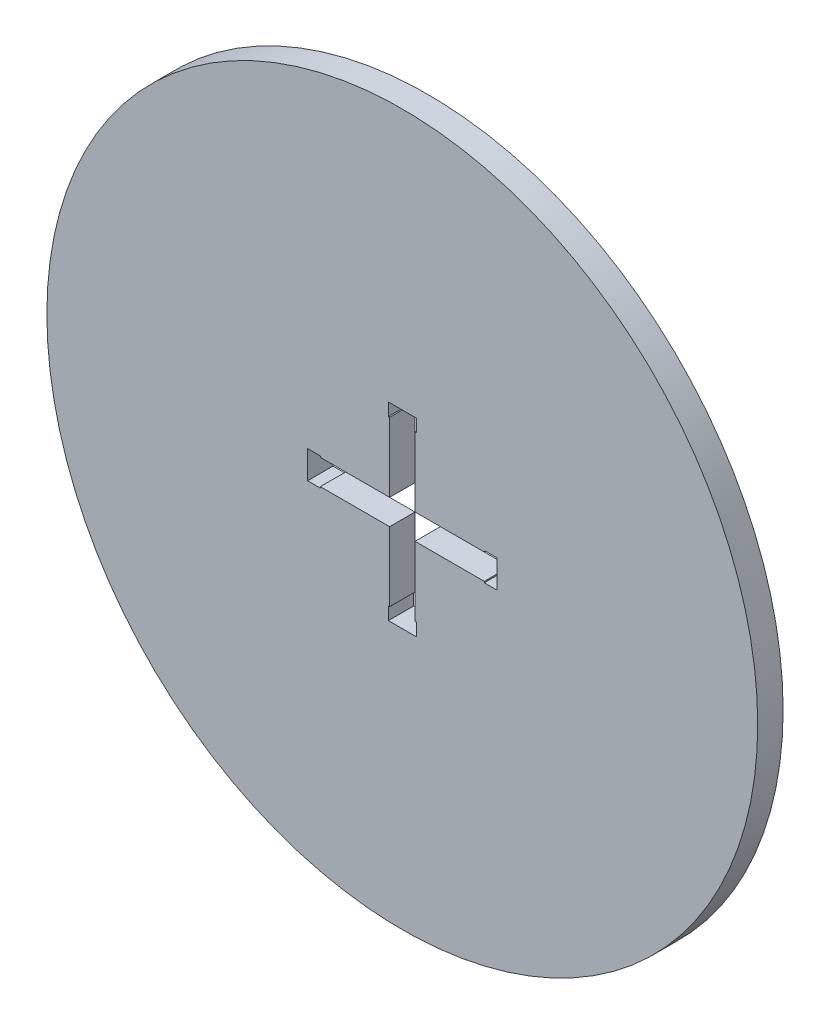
from build123d import *

# Parameters (mm, degrees)
CROQUIS1_R                                   = 177.8
SALIENTE_EXTRUIR1_DEPTH                      = 12.7
CORTAR_EXTRUIR3_DEPTH                        = 252.76769054
CROQUIS4_W                                   = 0.635
CROQUIS4_H                                   = 6.35
CROQUIS4_W_2                                 = 6.35
CROQUIS4_H_2                                 = 0.635
CORTAR_EXTRUIR4_DEPTH                        = 252.76769054
SIMETR_A1_AT_THE_SECOND_PLANE_COPY_1_SKE_W   = 0.635
SIMETR_A1_AT_THE_SECOND_PLANE_COPY_1_SKE_H   = 6.35
SIMETR_A1_AT_THE_SECOND_PLANE_COPY_1_SKE_W_2 = 6.35
SIMETR_A1_AT_THE_SECOND_PLANE_COPY_1_SKE_H_2 = 0.635
SIMETR_A1_AT_THE_SECOND_PLANE_COPY_1_DEPTH   = 252.76769054


with BuildPart() as part:
    # Croquis1 → Saliente-Extruir1 (new body)
    with BuildSketch(Plane.XY):
        Circle(CROQUIS1_R)
    extrude(amount=SALIENTE_EXTRUIR1_DEPTH)

    # Croquis3 → Cortar-Extruir3 (cut, through all)
    with BuildSketch(Plane.XY):
        Polygon((6.35, 47.371), (-6.35, 47.371), (-6.35, 6.35), (-47.371, 6.35), (-47.371, -6.35), (-6.35, -6.35), (-6.35, -47.371), (6.35, -47.371), (6.35, -6.35), (47.371, -6.35), (47.371, 6.35), (6.35, 6.35), align=None)
    extrude(amount=CORTAR_EXTRUIR3_DEPTH, mode=Mode.SUBTRACT)

    # Croquis4 → Cortar-Extruir4 (cut, through all)
    with BuildSketch(Plane(origin=(0, 0, 0), x_dir=(-1, 0, 0), z_dir=(0, 0, -1))):
        with Locations((-6.6675, 44.196)):
            Rectangle(CROQUIS4_W, CROQUIS4_H)
        with Locations((-44.196, 6.6675)):
            Rectangle(CROQUIS4_W_2, CROQUIS4_H_2)
    cortar_extruir4 = extrude(amount=-CORTAR_EXTRUIR4_DEPTH, mode=Mode.SUBTRACT)

    # Simetr_a1: Cortar-Extruir4 across plane
    add(cortar_extruir4.mirror(Plane(origin=(0, 0, 0), x_dir=(0, 0, 1), z_dir=(1, 0, 0))), mode=Mode.SUBTRACT)

    # Simetr_a1 at the second plane: Cortar-Extruir4 across plane
    add(cortar_extruir4.mirror(Plane.ZX), mode=Mode.SUBTRACT)

    # Simetr_a1 at the second plane copy 1 ske → Simetr_a1 at the second plane copy 1 (cut, through all)
    with BuildSketch(Plane(origin=(0, 0, 0), x_dir=(1, 0, 0), z_dir=(0, 0, -1))):
        with Locations((-6.6675, 44.196)):
            Rectangle(SIMETR_A1_AT_THE_SECOND_PLANE_COPY_1_SKE_W, SIMETR_A1_AT_THE_SECOND_PLANE_COPY_1_SKE_H)
        with Locations((-44.196, 6.6675)):
            Rectangle(SIMETR_A1_AT_THE_SECOND_PLANE_COPY_1_SKE_W_2, SIMETR_A1_AT_THE_SECOND_PLANE_COPY_1_SKE_H_2)
    extrude(amount=-SIMETR_A1_AT_THE_SECOND_PLANE_COPY_1_DEPTH, mode=Mode.SUBTRACT)


solid = part.part
